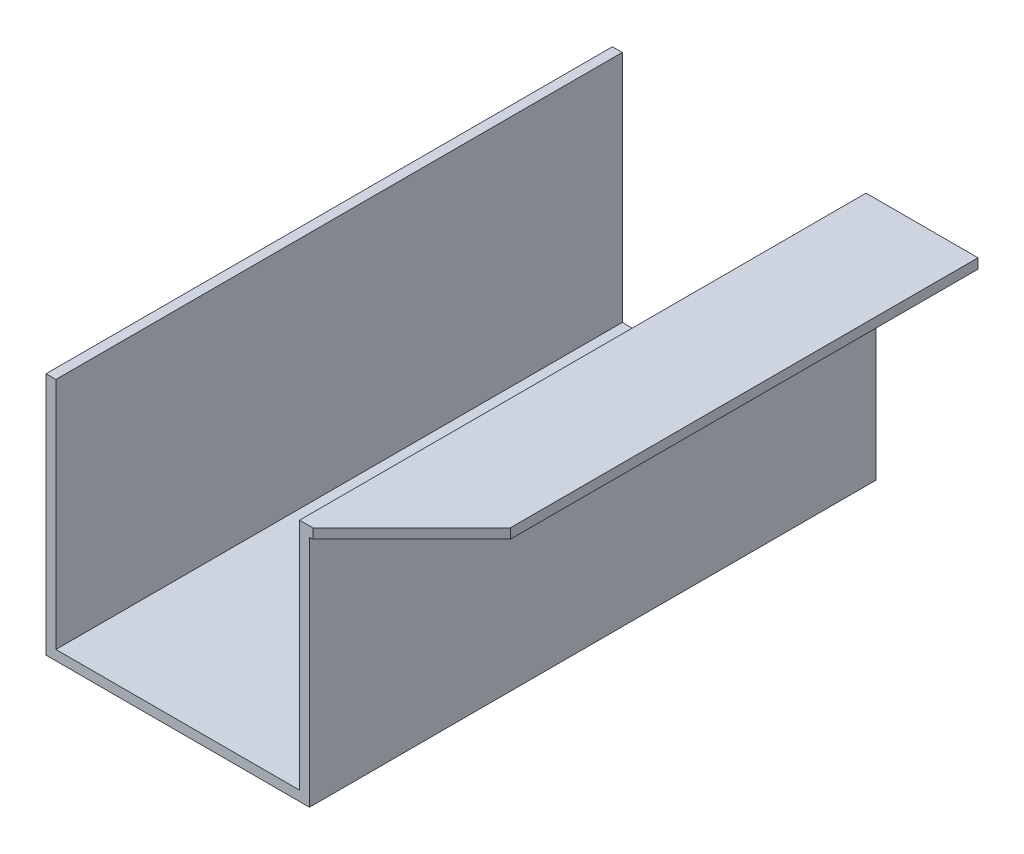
from build123d import *

# Parameters (mm, degrees)
EXTRUSION1_DEPTH = 86
CHANFREIN1_SIZE  = 15


with BuildPart() as part:
    # Esquisse1 → Extrusion1 (new body)
    with BuildSketch(Plane.XY):
        Polygon((0, 0), (0, -35.5), (37, -35.5), (37, 0), (54, 0), (54, -1.5), (38.5, -1.5), (38.5, -37), (-1.5, -37), (-1.5, 0), align=None)
    extrude(amount=EXTRUSION1_DEPTH)

    # Chanfrein1
    chanfrein1_edges = [part.edges().sort_by_distance(p)[0] for p in [
        (54, -0.75, 86),
    ]]
    chamfer(chanfrein1_edges, length=CHANFREIN1_SIZE)


solid = part.part
